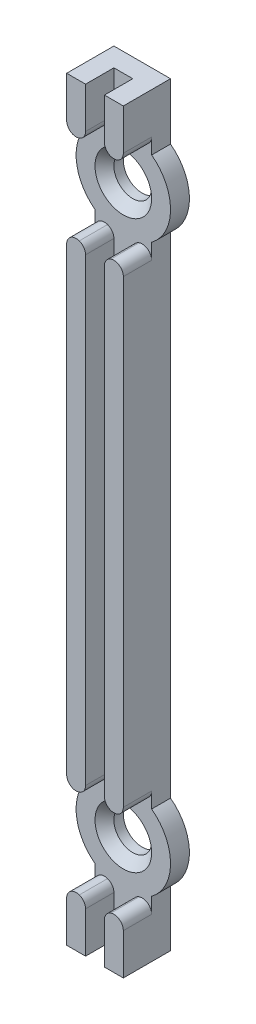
ISO-10303-21;
HEADER;
FILE_DESCRIPTION(('STEP AP214'),'2;1');
FILE_NAME('part.step','',(''),(''),'','','');
FILE_SCHEMA(('AUTOMOTIVE_DESIGN { 1 0 10303 214 1 1 1 1 }'));
ENDSEC;
DATA;
#1=APPLICATION_CONTEXT('core data for automotive mechanical design processes');
#2=APPLICATION_PROTOCOL_DEFINITION('international standard','automotive_design',2000,#1);
#3=PRODUCT_CONTEXT('',#1,'mechanical');
#4=PRODUCT('Part','Part','',(#3));
#5=PRODUCT_RELATED_PRODUCT_CATEGORY('part','',(#4));
#6=PRODUCT_DEFINITION_FORMATION('','',#4);
#7=PRODUCT_DEFINITION_CONTEXT('part definition',#1,'design');
#8=PRODUCT_DEFINITION('design','',#6,#7);
#9=PRODUCT_DEFINITION_SHAPE('','',#8);
#10=(LENGTH_UNIT() NAMED_UNIT(*) SI_UNIT(.MILLI.,.METRE.));
#11=(NAMED_UNIT(*) PLANE_ANGLE_UNIT() SI_UNIT($,.RADIAN.));
#12=(NAMED_UNIT(*) SI_UNIT($,.STERADIAN.) SOLID_ANGLE_UNIT());
#13=UNCERTAINTY_MEASURE_WITH_UNIT(LENGTH_MEASURE(1.E-05),#10,'distance_accuracy_value','');
#14=(GEOMETRIC_REPRESENTATION_CONTEXT(3) GLOBAL_UNCERTAINTY_ASSIGNED_CONTEXT((#13)) GLOBAL_UNIT_ASSIGNED_CONTEXT((#10,
#11,#12)) REPRESENTATION_CONTEXT('',''));
#15=CARTESIAN_POINT('',(0.,0.,0.));
#16=DIRECTION('',(0.,0.,1.));
#17=DIRECTION('',(1.,0.,0.));
#18=AXIS2_PLACEMENT_3D('',#15,#16,#17);
#19=CARTESIAN_POINT('',(0.,-39.7374179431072,5.));
#20=DIRECTION('',(0.,1.,0.));
#21=DIRECTION('',(0.,0.,1.));
#22=AXIS2_PLACEMENT_3D('',#19,#20,#21);
#23=PLANE('',#22);
#24=DIRECTION('',(0.,0.,1.));
#25=VECTOR('',#24,1.);
#26=CARTESIAN_POINT('',(-5.10537351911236,-39.7374179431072,2.));
#27=LINE('',#26,#25);
#28=CARTESIAN_POINT('',(-5.10537351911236,-39.7374179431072,2.));
#29=VERTEX_POINT('',#28);
#30=CARTESIAN_POINT('',(-5.10537351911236,-39.7374179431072,5.));
#31=VERTEX_POINT('',#30);
#32=EDGE_CURVE('E365',#29,#31,#27,.T.);
#33=ORIENTED_EDGE('',*,*,#32,.F.);
#34=DIRECTION('',(1.,0.,0.));
#35=VECTOR('',#34,1.);
#36=CARTESIAN_POINT('',(0.,-39.7374179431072,2.));
#37=LINE('',#36,#35);
#38=CARTESIAN_POINT('',(-7.10537351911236,-39.7374179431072,2.));
#39=VERTEX_POINT('',#38);
#40=EDGE_CURVE('E348',#39,#29,#37,.T.);
#41=ORIENTED_EDGE('',*,*,#40,.F.);
#42=DIRECTION('',(0.,0.,1.));
#43=VECTOR('',#42,1.);
#44=CARTESIAN_POINT('',(-7.10537351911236,-39.7374179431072,2.));
#45=LINE('',#44,#43);
#46=CARTESIAN_POINT('',(-7.10537351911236,-39.7374179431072,5.));
#47=VERTEX_POINT('',#46);
#48=EDGE_CURVE('E358',#39,#47,#45,.T.);
#49=ORIENTED_EDGE('',*,*,#48,.T.);
#50=DIRECTION('',(1.,0.,0.));
#51=VECTOR('',#50,1.);
#52=CARTESIAN_POINT('',(0.,-39.7374179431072,5.));
#53=LINE('',#52,#51);
#54=CARTESIAN_POINT('',(-9.10537351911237,-39.7374179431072,5.));
#55=VERTEX_POINT('',#54);
#56=EDGE_CURVE('E424',#55,#47,#53,.T.);
#57=ORIENTED_EDGE('',*,*,#56,.F.);
#58=DIRECTION('',(0.,0.,-1.));
#59=VECTOR('',#58,1.);
#60=CARTESIAN_POINT('',(-9.10537351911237,-39.7374179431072,5.));
#61=LINE('',#60,#59);
#62=CARTESIAN_POINT('',(-9.10537351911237,-39.7374179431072,0.));
#63=VERTEX_POINT('',#62);
#64=EDGE_CURVE('E490',#55,#63,#61,.T.);
#65=ORIENTED_EDGE('',*,*,#64,.T.);
#66=DIRECTION('',(1.,0.,0.));
#67=VECTOR('',#66,1.);
#68=CARTESIAN_POINT('',(0.,-39.7374179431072,0.));
#69=LINE('',#68,#67);
#70=CARTESIAN_POINT('',(-3.10537351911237,-39.7374179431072,0.));
#71=VERTEX_POINT('',#70);
#72=EDGE_CURVE('E452',#63,#71,#69,.T.);
#73=ORIENTED_EDGE('',*,*,#72,.T.);
#74=DIRECTION('',(0.,0.,-1.));
#75=VECTOR('',#74,1.);
#76=CARTESIAN_POINT('',(-3.10537351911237,-39.7374179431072,5.));
#77=LINE('',#76,#75);
#78=CARTESIAN_POINT('',(-3.10537351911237,-39.7374179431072,5.));
#79=VERTEX_POINT('',#78);
#80=EDGE_CURVE('E488',#79,#71,#77,.T.);
#81=ORIENTED_EDGE('',*,*,#80,.F.);
#82=EDGE_CURVE('E423',#31,#79,#53,.T.);
#83=ORIENTED_EDGE('',*,*,#82,.F.);
#84=EDGE_LOOP('',(#33,#41,#49,#57,#65,#73,#81,#83));
#85=FACE_BOUND('',#84,.T.);
#86=ADVANCED_FACE('F85',(#85),#23,.F.);
#87=CARTESIAN_POINT('',(-6.10537351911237,30.2625820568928,5.));
#88=DIRECTION('',(0.,0.,-1.));
#89=DIRECTION('',(-1.,0.,0.));
#90=AXIS2_PLACEMENT_3D('',#87,#88,#89);
#91=CYLINDRICAL_SURFACE('',#90,5.);
#92=CARTESIAN_POINT('',(-6.10537351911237,30.2625820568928,2.));
#93=DIRECTION('',(0.,0.,1.));
#94=DIRECTION('',(1.,0.,0.));
#95=AXIS2_PLACEMENT_3D('',#92,#93,#94);
#96=CIRCLE('',#95,5.);
#97=CARTESIAN_POINT('',(-3.10537351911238,26.2625820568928,2.));
#98=VERTEX_POINT('',#97);
#99=CARTESIAN_POINT('',(-3.10537351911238,34.2625820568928,2.));
#100=VERTEX_POINT('',#99);
#101=EDGE_CURVE('E380',#98,#100,#96,.T.);
#102=ORIENTED_EDGE('',*,*,#101,.F.);
#103=DIRECTION('',(0.,0.,-1.));
#104=VECTOR('',#103,1.);
#105=CARTESIAN_POINT('',(-3.10537351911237,26.2625820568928,5.));
#106=LINE('',#105,#104);
#107=CARTESIAN_POINT('',(-3.10537351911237,26.2625820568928,0.));
#108=VERTEX_POINT('',#107);
#109=EDGE_CURVE('E482',#98,#108,#106,.T.);
#110=ORIENTED_EDGE('',*,*,#109,.T.);
#111=CARTESIAN_POINT('',(-6.10537351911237,30.2625820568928,0.));
#112=DIRECTION('',(0.,0.,1.));
#113=DIRECTION('',(1.,0.,0.));
#114=AXIS2_PLACEMENT_3D('',#111,#112,#113);
#115=CIRCLE('',#114,5.);
#116=CARTESIAN_POINT('',(-3.10537351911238,34.2625820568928,0.));
#117=VERTEX_POINT('',#116);
#118=EDGE_CURVE('E464',#108,#117,#115,.T.);
#119=ORIENTED_EDGE('',*,*,#118,.T.);
#120=DIRECTION('',(0.,0.,-1.));
#121=VECTOR('',#120,1.);
#122=CARTESIAN_POINT('',(-3.10537351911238,34.2625820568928,5.));
#123=LINE('',#122,#121);
#124=EDGE_CURVE('E480',#100,#117,#123,.T.);
#125=ORIENTED_EDGE('',*,*,#124,.F.);
#126=EDGE_LOOP('',(#102,#110,#119,#125));
#127=FACE_BOUND('',#126,.T.);
#128=ADVANCED_FACE('F703',(#127),#91,.T.);
#129=CARTESIAN_POINT('',(0.,0.,5.));
#130=DIRECTION('',(0.,0.,1.));
#131=DIRECTION('',(1.,0.,0.));
#132=AXIS2_PLACEMENT_3D('',#129,#130,#131);
#133=PLANE('',#132);
#134=CARTESIAN_POINT('',(-4.10537351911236,35.9194363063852,5.));
#135=DIRECTION('',(0.,0.,1.));
#136=DIRECTION('',(1.,0.,0.));
#137=AXIS2_PLACEMENT_3D('',#134,#135,#136);
#138=CIRCLE('',#137,1.);
#139=CARTESIAN_POINT('',(-5.10537351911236,35.9194363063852,5.));
#140=VERTEX_POINT('',#139);
#141=CARTESIAN_POINT('',(-4.4387068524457,34.9766272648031,5.));
#142=VERTEX_POINT('',#141);
#143=EDGE_CURVE('E518',#140,#142,#138,.T.);
#144=ORIENTED_EDGE('',*,*,#143,.T.);
#145=CARTESIAN_POINT('',(-4.10537351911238,35.9194363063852,5.));
#146=DIRECTION('',(0.,0.,1.));
#147=DIRECTION('',(1.,0.,0.));
#148=AXIS2_PLACEMENT_3D('',#145,#146,#147);
#149=CIRCLE('',#148,1.);
#150=CARTESIAN_POINT('',(-3.10537351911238,35.9194363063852,5.));
#151=VERTEX_POINT('',#150);
#152=EDGE_CURVE('E520',#142,#151,#149,.T.);
#153=ORIENTED_EDGE('',*,*,#152,.T.);
#154=DIRECTION('',(0.,-1.,0.));
#155=VECTOR('',#154,1.);
#156=CARTESIAN_POINT('',(-3.10537351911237,0.,5.));
#157=LINE('',#156,#155);
#158=CARTESIAN_POINT('',(-3.10537351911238,40.2625820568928,5.));
#159=VERTEX_POINT('',#158);
#160=EDGE_CURVE('E431',#159,#151,#157,.T.);
#161=ORIENTED_EDGE('',*,*,#160,.F.);
#162=DIRECTION('',(1.,0.,0.));
#163=VECTOR('',#162,1.);
#164=CARTESIAN_POINT('',(0.,40.2625820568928,5.));
#165=LINE('',#164,#163);
#166=CARTESIAN_POINT('',(-5.10537351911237,40.2625820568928,5.));
#167=VERTEX_POINT('',#166);
#168=EDGE_CURVE('E434',#167,#159,#165,.T.);
#169=ORIENTED_EDGE('',*,*,#168,.F.);
#170=DIRECTION('',(0.,-1.,0.));
#171=VECTOR('',#170,1.);
#172=CARTESIAN_POINT('',(-5.10537351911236,0.,5.));
#173=LINE('',#172,#171);
#174=EDGE_CURVE('E404',#167,#140,#173,.T.);
#175=ORIENTED_EDGE('',*,*,#174,.T.);
#176=EDGE_LOOP('',(#144,#153,#161,#169,#175));
#177=FACE_BOUND('',#176,.T.);
#178=ADVANCED_FACE('F708',(#177),#133,.T.);
#179=CARTESIAN_POINT('',(-8.10537351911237,35.9194363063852,5.));
#180=DIRECTION('',(0.,0.,1.));
#181=DIRECTION('',(1.,0.,0.));
#182=AXIS2_PLACEMENT_3D('',#179,#180,#181);
#183=CIRCLE('',#182,1.);
#184=CARTESIAN_POINT('',(-9.10537351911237,35.9194363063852,5.));
#185=VERTEX_POINT('',#184);
#186=CARTESIAN_POINT('',(-7.77204018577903,34.9766272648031,5.));
#187=VERTEX_POINT('',#186);
#188=EDGE_CURVE('E524',#185,#187,#183,.T.);
#189=ORIENTED_EDGE('',*,*,#188,.T.);
#190=CARTESIAN_POINT('',(-8.10537351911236,35.9194363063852,5.));
#191=DIRECTION('',(0.,0.,1.));
#192=DIRECTION('',(1.,0.,0.));
#193=AXIS2_PLACEMENT_3D('',#190,#191,#192);
#194=CIRCLE('',#193,1.);
#195=CARTESIAN_POINT('',(-7.10537351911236,35.9194363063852,5.));
#196=VERTEX_POINT('',#195);
#197=EDGE_CURVE('E526',#187,#196,#194,.T.);
#198=ORIENTED_EDGE('',*,*,#197,.T.);
#199=DIRECTION('',(0.,-1.,0.));
#200=VECTOR('',#199,1.);
#201=CARTESIAN_POINT('',(-7.10537351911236,0.,5.));
#202=LINE('',#201,#200);
#203=CARTESIAN_POINT('',(-7.10537351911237,40.2625820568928,5.));
#204=VERTEX_POINT('',#203);
#205=EDGE_CURVE('E407',#204,#196,#202,.T.);
#206=ORIENTED_EDGE('',*,*,#205,.F.);
#207=CARTESIAN_POINT('',(-9.10537351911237,40.2625820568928,5.));
#208=VERTEX_POINT('',#207);
#209=EDGE_CURVE('E435',#208,#204,#165,.T.);
#210=ORIENTED_EDGE('',*,*,#209,.F.);
#211=DIRECTION('',(0.,-1.,0.));
#212=VECTOR('',#211,1.);
#213=CARTESIAN_POINT('',(-9.10537351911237,0.,5.));
#214=LINE('',#213,#212);
#215=EDGE_CURVE('E438',#208,#185,#214,.T.);
#216=ORIENTED_EDGE('',*,*,#215,.T.);
#217=EDGE_LOOP('',(#189,#198,#206,#210,#216));
#218=FACE_BOUND('',#217,.T.);
#219=ADVANCED_FACE('F847',(#218),#133,.T.);
#220=DIRECTION('',(0.,-1.,0.));
#221=VECTOR('',#220,1.);
#222=CARTESIAN_POINT('',(-3.10537351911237,0.,5.));
#223=LINE('',#222,#221);
#224=CARTESIAN_POINT('',(-3.10537351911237,24.6057278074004,5.));
#225=VERTEX_POINT('',#224);
#226=CARTESIAN_POINT('',(-3.10537351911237,-24.0805636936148,5.));
#227=VERTEX_POINT('',#226);
#228=EDGE_CURVE('E428',#225,#227,#223,.T.);
#229=ORIENTED_EDGE('',*,*,#228,.F.);
#230=CARTESIAN_POINT('',(-4.10537351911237,24.6057278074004,5.));
#231=DIRECTION('',(0.,0.,1.));
#232=DIRECTION('',(1.,0.,0.));
#233=AXIS2_PLACEMENT_3D('',#230,#231,#232);
#234=CIRCLE('',#233,1.);
#235=CARTESIAN_POINT('',(-4.4387068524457,25.5485368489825,5.));
#236=VERTEX_POINT('',#235);
#237=EDGE_CURVE('E553',#225,#236,#234,.T.);
#238=ORIENTED_EDGE('',*,*,#237,.T.);
#239=CARTESIAN_POINT('',(-4.10537351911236,24.6057278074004,5.));
#240=DIRECTION('',(0.,0.,1.));
#241=DIRECTION('',(1.,0.,0.));
#242=AXIS2_PLACEMENT_3D('',#239,#240,#241);
#243=CIRCLE('',#242,1.);
#244=CARTESIAN_POINT('',(-5.10537351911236,24.6057278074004,5.));
#245=VERTEX_POINT('',#244);
#246=EDGE_CURVE('E551',#236,#245,#243,.T.);
#247=ORIENTED_EDGE('',*,*,#246,.T.);
#248=DIRECTION('',(0.,-1.,0.));
#249=VECTOR('',#248,1.);
#250=CARTESIAN_POINT('',(-5.10537351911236,0.,5.));
#251=LINE('',#250,#249);
#252=CARTESIAN_POINT('',(-5.10537351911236,-24.0805636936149,5.));
#253=VERTEX_POINT('',#252);
#254=EDGE_CURVE('E401',#245,#253,#251,.T.);
#255=ORIENTED_EDGE('',*,*,#254,.T.);
#256=CARTESIAN_POINT('',(-4.10537351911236,-24.0805636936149,5.));
#257=DIRECTION('',(0.,0.,1.));
#258=DIRECTION('',(1.,0.,0.));
#259=AXIS2_PLACEMENT_3D('',#256,#257,#258);
#260=CIRCLE('',#259,1.);
#261=CARTESIAN_POINT('',(-4.4387068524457,-25.0233727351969,5.));
#262=VERTEX_POINT('',#261);
#263=EDGE_CURVE('E549',#253,#262,#260,.T.);
#264=ORIENTED_EDGE('',*,*,#263,.T.);
#265=CARTESIAN_POINT('',(-4.10537351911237,-24.0805636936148,5.));
#266=DIRECTION('',(0.,0.,1.));
#267=DIRECTION('',(1.,0.,0.));
#268=AXIS2_PLACEMENT_3D('',#265,#266,#267);
#269=CIRCLE('',#268,1.);
#270=EDGE_CURVE('E547',#262,#227,#269,.T.);
#271=ORIENTED_EDGE('',*,*,#270,.T.);
#272=EDGE_LOOP('',(#229,#238,#247,#255,#264,#271));
#273=FACE_BOUND('',#272,.T.);
#274=ADVANCED_FACE('F845',(#273),#133,.T.);
#275=CARTESIAN_POINT('',(-4.10537351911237,-35.3942721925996,5.));
#276=DIRECTION('',(0.,0.,1.));
#277=DIRECTION('',(1.,0.,0.));
#278=AXIS2_PLACEMENT_3D('',#275,#276,#277);
#279=CIRCLE('',#278,1.);
#280=CARTESIAN_POINT('',(-3.10537351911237,-35.3942721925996,5.));
#281=VERTEX_POINT('',#280);
#282=CARTESIAN_POINT('',(-4.4387068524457,-34.4514631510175,5.));
#283=VERTEX_POINT('',#282);
#284=EDGE_CURVE('E581',#281,#283,#279,.T.);
#285=ORIENTED_EDGE('',*,*,#284,.T.);
#286=CARTESIAN_POINT('',(-4.10537351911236,-35.3942721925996,5.));
#287=DIRECTION('',(0.,0.,1.));
#288=DIRECTION('',(1.,0.,0.));
#289=AXIS2_PLACEMENT_3D('',#286,#287,#288);
#290=CIRCLE('',#289,1.);
#291=CARTESIAN_POINT('',(-5.10537351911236,-35.3942721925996,5.));
#292=VERTEX_POINT('',#291);
#293=EDGE_CURVE('E583',#283,#292,#290,.T.);
#294=ORIENTED_EDGE('',*,*,#293,.T.);
#295=DIRECTION('',(0.,-1.,0.));
#296=VECTOR('',#295,1.);
#297=CARTESIAN_POINT('',(-5.10537351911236,0.,5.));
#298=LINE('',#297,#296);
#299=EDGE_CURVE('E399',#292,#31,#298,.T.);
#300=ORIENTED_EDGE('',*,*,#299,.T.);
#301=ORIENTED_EDGE('',*,*,#82,.T.);
#302=DIRECTION('',(0.,-1.,0.));
#303=VECTOR('',#302,1.);
#304=CARTESIAN_POINT('',(-3.10537351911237,0.,5.));
#305=LINE('',#304,#303);
#306=EDGE_CURVE('E426',#281,#79,#305,.T.);
#307=ORIENTED_EDGE('',*,*,#306,.F.);
#308=EDGE_LOOP('',(#285,#294,#300,#301,#307));
#309=FACE_BOUND('',#308,.T.);
#310=ADVANCED_FACE('F682',(#309),#133,.T.);
#311=CARTESIAN_POINT('',(-8.10537351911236,24.6057278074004,5.));
#312=DIRECTION('',(0.,0.,1.));
#313=DIRECTION('',(1.,0.,0.));
#314=AXIS2_PLACEMENT_3D('',#311,#312,#313);
#315=CIRCLE('',#314,1.);
#316=CARTESIAN_POINT('',(-7.10537351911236,24.6057278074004,5.));
#317=VERTEX_POINT('',#316);
#318=CARTESIAN_POINT('',(-7.77204018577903,25.5485368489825,5.));
#319=VERTEX_POINT('',#318);
#320=EDGE_CURVE('E572',#317,#319,#315,.T.);
#321=ORIENTED_EDGE('',*,*,#320,.T.);
#322=CARTESIAN_POINT('',(-8.10537351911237,24.6057278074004,5.));
#323=DIRECTION('',(0.,0.,1.));
#324=DIRECTION('',(1.,0.,0.));
#325=AXIS2_PLACEMENT_3D('',#322,#323,#324);
#326=CIRCLE('',#325,1.);
#327=CARTESIAN_POINT('',(-9.10537351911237,24.6057278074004,5.));
#328=VERTEX_POINT('',#327);
#329=EDGE_CURVE('E574',#319,#328,#326,.T.);
#330=ORIENTED_EDGE('',*,*,#329,.T.);
#331=DIRECTION('',(0.,-1.,0.));
#332=VECTOR('',#331,1.);
#333=CARTESIAN_POINT('',(-9.10537351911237,0.,5.));
#334=LINE('',#333,#332);
#335=CARTESIAN_POINT('',(-9.10537351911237,-24.0805636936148,5.));
#336=VERTEX_POINT('',#335);
#337=EDGE_CURVE('E417',#328,#336,#334,.T.);
#338=ORIENTED_EDGE('',*,*,#337,.T.);
#339=CARTESIAN_POINT('',(-8.10537351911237,-24.0805636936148,5.));
#340=DIRECTION('',(0.,0.,1.));
#341=DIRECTION('',(1.,0.,0.));
#342=AXIS2_PLACEMENT_3D('',#339,#340,#341);
#343=CIRCLE('',#342,1.);
#344=CARTESIAN_POINT('',(-7.77204018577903,-25.0233727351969,5.));
#345=VERTEX_POINT('',#344);
#346=EDGE_CURVE('E568',#336,#345,#343,.T.);
#347=ORIENTED_EDGE('',*,*,#346,.T.);
#348=CARTESIAN_POINT('',(-8.10537351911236,-24.0805636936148,5.));
#349=DIRECTION('',(0.,0.,1.));
#350=DIRECTION('',(1.,0.,0.));
#351=AXIS2_PLACEMENT_3D('',#348,#349,#350);
#352=CIRCLE('',#351,1.);
#353=CARTESIAN_POINT('',(-7.10537351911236,-24.0805636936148,5.));
#354=VERTEX_POINT('',#353);
#355=EDGE_CURVE('E570',#345,#354,#352,.T.);
#356=ORIENTED_EDGE('',*,*,#355,.T.);
#357=DIRECTION('',(0.,-1.,0.));
#358=VECTOR('',#357,1.);
#359=CARTESIAN_POINT('',(-7.10537351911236,0.,5.));
#360=LINE('',#359,#358);
#361=EDGE_CURVE('E394',#317,#354,#360,.T.);
#362=ORIENTED_EDGE('',*,*,#361,.F.);
#363=EDGE_LOOP('',(#321,#330,#338,#347,#356,#362));
#364=FACE_BOUND('',#363,.T.);
#365=ADVANCED_FACE('F795',(#364),#133,.T.);
#366=CARTESIAN_POINT('',(-6.10537351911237,-29.7374179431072,5.));
#367=DIRECTION('',(0.,0.,-1.));
#368=DIRECTION('',(-1.,0.,0.));
#369=AXIS2_PLACEMENT_3D('',#366,#367,#368);
#370=CYLINDRICAL_SURFACE('',#369,5.);
#371=CARTESIAN_POINT('',(-6.10537351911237,-29.7374179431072,2.));
#372=DIRECTION('',(0.,0.,1.));
#373=DIRECTION('',(1.,0.,0.));
#374=AXIS2_PLACEMENT_3D('',#371,#372,#373);
#375=CIRCLE('',#374,5.);
#376=CARTESIAN_POINT('',(-3.10537351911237,-33.7374179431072,2.));
#377=VERTEX_POINT('',#376);
#378=CARTESIAN_POINT('',(-3.10537351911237,-25.7374179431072,2.));
#379=VERTEX_POINT('',#378);
#380=EDGE_CURVE('E372',#377,#379,#375,.T.);
#381=ORIENTED_EDGE('',*,*,#380,.F.);
#382=DIRECTION('',(0.,0.,-1.));
#383=VECTOR('',#382,1.);
#384=CARTESIAN_POINT('',(-3.10537351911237,-33.7374179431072,5.));
#385=LINE('',#384,#383);
#386=CARTESIAN_POINT('',(-3.10537351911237,-33.7374179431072,0.));
#387=VERTEX_POINT('',#386);
#388=EDGE_CURVE('E486',#377,#387,#385,.T.);
#389=ORIENTED_EDGE('',*,*,#388,.T.);
#390=CARTESIAN_POINT('',(-6.10537351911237,-29.7374179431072,0.));
#391=DIRECTION('',(0.,0.,1.));
#392=DIRECTION('',(1.,0.,0.));
#393=AXIS2_PLACEMENT_3D('',#390,#391,#392);
#394=CIRCLE('',#393,5.);
#395=CARTESIAN_POINT('',(-3.10537351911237,-25.7374179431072,0.));
#396=VERTEX_POINT('',#395);
#397=EDGE_CURVE('E458',#387,#396,#394,.T.);
#398=ORIENTED_EDGE('',*,*,#397,.T.);
#399=DIRECTION('',(0.,0.,-1.));
#400=VECTOR('',#399,1.);
#401=CARTESIAN_POINT('',(-3.10537351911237,-25.7374179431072,5.));
#402=LINE('',#401,#400);
#403=EDGE_CURVE('E484',#379,#396,#402,.T.);
#404=ORIENTED_EDGE('',*,*,#403,.F.);
#405=EDGE_LOOP('',(#381,#389,#398,#404));
#406=FACE_BOUND('',#405,.T.);
#407=ADVANCED_FACE('F730',(#406),#370,.T.);
#408=CARTESIAN_POINT('',(-6.10537351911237,30.2625820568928,5.));
#409=DIRECTION('',(0.,0.,-1.));
#410=DIRECTION('',(-1.,0.,0.));
#411=AXIS2_PLACEMENT_3D('',#408,#409,#410);
#412=CYLINDRICAL_SURFACE('',#411,5.);
#413=CARTESIAN_POINT('',(-6.10537351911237,30.2625820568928,2.));
#414=DIRECTION('',(0.,0.,1.));
#415=DIRECTION('',(1.,0.,0.));
#416=AXIS2_PLACEMENT_3D('',#413,#414,#415);
#417=CIRCLE('',#416,5.);
#418=CARTESIAN_POINT('',(-9.10537351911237,34.2625820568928,2.));
#419=VERTEX_POINT('',#418);
#420=CARTESIAN_POINT('',(-9.10537351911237,26.2625820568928,2.));
#421=VERTEX_POINT('',#420);
#422=EDGE_CURVE('E366',#419,#421,#417,.T.);
#423=ORIENTED_EDGE('',*,*,#422,.F.);
#424=DIRECTION('',(0.,0.,-1.));
#425=VECTOR('',#424,1.);
#426=CARTESIAN_POINT('',(-9.10537351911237,34.2625820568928,5.));
#427=LINE('',#426,#425);
#428=CARTESIAN_POINT('',(-9.10537351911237,34.2625820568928,0.));
#429=VERTEX_POINT('',#428);
#430=EDGE_CURVE('E441',#419,#429,#427,.T.);
#431=ORIENTED_EDGE('',*,*,#430,.T.);
#432=CARTESIAN_POINT('',(-6.10537351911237,30.2625820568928,0.));
#433=DIRECTION('',(0.,0.,1.));
#434=DIRECTION('',(1.,0.,0.));
#435=AXIS2_PLACEMENT_3D('',#432,#433,#434);
#436=CIRCLE('',#435,5.);
#437=CARTESIAN_POINT('',(-9.10537351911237,26.2625820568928,0.));
#438=VERTEX_POINT('',#437);
#439=EDGE_CURVE('E412',#429,#438,#436,.T.);
#440=ORIENTED_EDGE('',*,*,#439,.T.);
#441=DIRECTION('',(0.,0.,-1.));
#442=VECTOR('',#441,1.);
#443=CARTESIAN_POINT('',(-9.10537351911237,26.2625820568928,5.));
#444=LINE('',#443,#442);
#445=EDGE_CURVE('E497',#421,#438,#444,.T.);
#446=ORIENTED_EDGE('',*,*,#445,.F.);
#447=EDGE_LOOP('',(#423,#431,#440,#446));
#448=FACE_BOUND('',#447,.T.);
#449=ADVANCED_FACE('F722',(#448),#412,.T.);
#450=CARTESIAN_POINT('',(-6.10537351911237,-29.7374179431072,5.));
#451=DIRECTION('',(0.,0.,-1.));
#452=DIRECTION('',(-1.,0.,0.));
#453=AXIS2_PLACEMENT_3D('',#450,#451,#452);
#454=CYLINDRICAL_SURFACE('',#453,5.);
#455=CARTESIAN_POINT('',(-6.10537351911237,-29.7374179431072,2.));
#456=DIRECTION('',(0.,0.,1.));
#457=DIRECTION('',(1.,0.,0.));
#458=AXIS2_PLACEMENT_3D('',#455,#456,#457);
#459=CIRCLE('',#458,5.);
#460=CARTESIAN_POINT('',(-9.10537351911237,-25.7374179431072,2.));
#461=VERTEX_POINT('',#460);
#462=CARTESIAN_POINT('',(-9.10537351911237,-33.7374179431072,2.));
#463=VERTEX_POINT('',#462);
#464=EDGE_CURVE('E499',#461,#463,#459,.T.);
#465=ORIENTED_EDGE('',*,*,#464,.F.);
#466=DIRECTION('',(0.,0.,-1.));
#467=VECTOR('',#466,1.);
#468=CARTESIAN_POINT('',(-9.10537351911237,-25.7374179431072,5.));
#469=LINE('',#468,#467);
#470=CARTESIAN_POINT('',(-9.10537351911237,-25.7374179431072,0.));
#471=VERTEX_POINT('',#470);
#472=EDGE_CURVE('E495',#461,#471,#469,.T.);
#473=ORIENTED_EDGE('',*,*,#472,.T.);
#474=CARTESIAN_POINT('',(-6.10537351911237,-29.7374179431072,0.));
#475=DIRECTION('',(0.,0.,1.));
#476=DIRECTION('',(1.,0.,0.));
#477=AXIS2_PLACEMENT_3D('',#474,#475,#476);
#478=CIRCLE('',#477,5.);
#479=CARTESIAN_POINT('',(-9.10537351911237,-33.7374179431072,0.));
#480=VERTEX_POINT('',#479);
#481=EDGE_CURVE('E447',#471,#480,#478,.T.);
#482=ORIENTED_EDGE('',*,*,#481,.T.);
#483=DIRECTION('',(0.,0.,-1.));
#484=VECTOR('',#483,1.);
#485=CARTESIAN_POINT('',(-9.10537351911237,-33.7374179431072,5.));
#486=LINE('',#485,#484);
#487=EDGE_CURVE('E493',#463,#480,#486,.T.);
#488=ORIENTED_EDGE('',*,*,#487,.F.);
#489=EDGE_LOOP('',(#465,#473,#482,#488));
#490=FACE_BOUND('',#489,.T.);
#491=ADVANCED_FACE('F718',(#490),#454,.T.);
#492=CARTESIAN_POINT('',(-3.10537351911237,0.,5.));
#493=DIRECTION('',(1.,0.,0.));
#494=DIRECTION('',(0.,1.,0.));
#495=AXIS2_PLACEMENT_3D('',#492,#493,#494);
#496=PLANE('',#495);
#497=ORIENTED_EDGE('',*,*,#160,.T.);
#498=DIRECTION('',(0.,0.,-1.));
#499=VECTOR('',#498,1.);
#500=CARTESIAN_POINT('',(-3.10537351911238,35.9194363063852,2.));
#501=LINE('',#500,#499);
#502=CARTESIAN_POINT('',(-3.10537351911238,35.9194363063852,2.));
#503=VERTEX_POINT('',#502);
#504=EDGE_CURVE('E515',#151,#503,#501,.T.);
#505=ORIENTED_EDGE('',*,*,#504,.T.);
#506=DIRECTION('',(0.,-1.,0.));
#507=VECTOR('',#506,1.);
#508=CARTESIAN_POINT('',(-3.10537351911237,0.,2.));
#509=LINE('',#508,#507);
#510=EDGE_CURVE('E513',#503,#100,#509,.T.);
#511=ORIENTED_EDGE('',*,*,#510,.T.);
#512=ORIENTED_EDGE('',*,*,#124,.T.);
#513=DIRECTION('',(0.,-1.,0.));
#514=VECTOR('',#513,1.);
#515=CARTESIAN_POINT('',(-3.10537351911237,0.,0.));
#516=LINE('',#515,#514);
#517=CARTESIAN_POINT('',(-3.10537351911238,40.2625820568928,0.));
#518=VERTEX_POINT('',#517);
#519=EDGE_CURVE('E467',#518,#117,#516,.T.);
#520=ORIENTED_EDGE('',*,*,#519,.F.);
#521=DIRECTION('',(0.,0.,-1.));
#522=VECTOR('',#521,1.);
#523=CARTESIAN_POINT('',(-3.10537351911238,40.2625820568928,5.));
#524=LINE('',#523,#522);
#525=EDGE_CURVE('E478',#159,#518,#524,.T.);
#526=ORIENTED_EDGE('',*,*,#525,.F.);
#527=EDGE_LOOP('',(#497,#505,#511,#512,#520,#526));
#528=FACE_BOUND('',#527,.T.);
#529=ADVANCED_FACE('F721',(#528),#496,.T.);
#530=CARTESIAN_POINT('',(-3.10537351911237,0.,5.));
#531=DIRECTION('',(1.,0.,0.));
#532=DIRECTION('',(0.,1.,0.));
#533=AXIS2_PLACEMENT_3D('',#530,#531,#532);
#534=PLANE('',#533);
#535=ORIENTED_EDGE('',*,*,#109,.F.);
#536=DIRECTION('',(0.,-1.,0.));
#537=VECTOR('',#536,1.);
#538=CARTESIAN_POINT('',(-3.10537351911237,0.,2.));
#539=LINE('',#538,#537);
#540=CARTESIAN_POINT('',(-3.10537351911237,24.6057278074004,2.));
#541=VERTEX_POINT('',#540);
#542=EDGE_CURVE('E544',#98,#541,#539,.T.);
#543=ORIENTED_EDGE('',*,*,#542,.T.);
#544=DIRECTION('',(0.,0.,-1.));
#545=VECTOR('',#544,1.);
#546=CARTESIAN_POINT('',(-3.10537351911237,24.6057278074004,5.));
#547=LINE('',#546,#545);
#548=EDGE_CURVE('E541',#541,#225,#547,.F.);
#549=ORIENTED_EDGE('',*,*,#548,.T.);
#550=ORIENTED_EDGE('',*,*,#228,.T.);
#551=DIRECTION('',(0.,0.,-1.));
#552=VECTOR('',#551,1.);
#553=CARTESIAN_POINT('',(-3.10537351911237,-24.0805636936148,2.));
#554=LINE('',#553,#552);
#555=CARTESIAN_POINT('',(-3.10537351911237,-24.0805636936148,2.));
#556=VERTEX_POINT('',#555);
#557=EDGE_CURVE('E538',#227,#556,#554,.T.);
#558=ORIENTED_EDGE('',*,*,#557,.T.);
#559=DIRECTION('',(0.,-1.,0.));
#560=VECTOR('',#559,1.);
#561=CARTESIAN_POINT('',(-3.10537351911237,0.,2.));
#562=LINE('',#561,#560);
#563=EDGE_CURVE('E536',#556,#379,#562,.T.);
#564=ORIENTED_EDGE('',*,*,#563,.T.);
#565=ORIENTED_EDGE('',*,*,#403,.T.);
#566=DIRECTION('',(0.,-1.,0.));
#567=VECTOR('',#566,1.);
#568=CARTESIAN_POINT('',(-3.10537351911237,0.,0.));
#569=LINE('',#568,#567);
#570=EDGE_CURVE('E461',#108,#396,#569,.T.);
#571=ORIENTED_EDGE('',*,*,#570,.F.);
#572=EDGE_LOOP('',(#535,#543,#549,#550,#558,#564,#565,#571));
#573=FACE_BOUND('',#572,.T.);
#574=ADVANCED_FACE('F823',(#573),#534,.T.);
#575=CARTESIAN_POINT('',(-3.10537351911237,0.,5.));
#576=DIRECTION('',(1.,0.,0.));
#577=DIRECTION('',(0.,1.,0.));
#578=AXIS2_PLACEMENT_3D('',#575,#576,#577);
#579=PLANE('',#578);
#580=ORIENTED_EDGE('',*,*,#388,.F.);
#581=DIRECTION('',(0.,-1.,0.));
#582=VECTOR('',#581,1.);
#583=CARTESIAN_POINT('',(-3.10537351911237,0.,2.));
#584=LINE('',#583,#582);
#585=CARTESIAN_POINT('',(-3.10537351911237,-35.3942721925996,2.));
#586=VERTEX_POINT('',#585);
#587=EDGE_CURVE('E109',#377,#586,#584,.T.);
#588=ORIENTED_EDGE('',*,*,#587,.T.);
#589=DIRECTION('',(0.,0.,-1.));
#590=VECTOR('',#589,1.);
#591=CARTESIAN_POINT('',(-3.10537351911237,-35.3942721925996,5.));
#592=LINE('',#591,#590);
#593=EDGE_CURVE('E599',#586,#281,#592,.F.);
#594=ORIENTED_EDGE('',*,*,#593,.T.);
#595=ORIENTED_EDGE('',*,*,#306,.T.);
#596=ORIENTED_EDGE('',*,*,#80,.T.);
#597=DIRECTION('',(0.,-1.,0.));
#598=VECTOR('',#597,1.);
#599=CARTESIAN_POINT('',(-3.10537351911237,0.,0.));
#600=LINE('',#599,#598);
#601=EDGE_CURVE('E455',#387,#71,#600,.T.);
#602=ORIENTED_EDGE('',*,*,#601,.F.);
#603=EDGE_LOOP('',(#580,#588,#594,#595,#596,#602));
#604=FACE_BOUND('',#603,.T.);
#605=ADVANCED_FACE('F677',(#604),#579,.T.);
#606=CARTESIAN_POINT('',(-9.10537351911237,0.,5.));
#607=DIRECTION('',(1.,0.,0.));
#608=DIRECTION('',(0.,0.,-1.));
#609=AXIS2_PLACEMENT_3D('',#606,#607,#608);
#610=PLANE('',#609);
#611=ORIENTED_EDGE('',*,*,#430,.F.);
#612=DIRECTION('',(0.,1.,0.));
#613=VECTOR('',#612,1.);
#614=CARTESIAN_POINT('',(-9.10537351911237,0.,2.));
#615=LINE('',#614,#613);
#616=CARTESIAN_POINT('',(-9.10537351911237,35.9194363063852,2.));
#617=VERTEX_POINT('',#616);
#618=EDGE_CURVE('E533',#419,#617,#615,.T.);
#619=ORIENTED_EDGE('',*,*,#618,.T.);
#620=DIRECTION('',(0.,0.,1.));
#621=VECTOR('',#620,1.);
#622=CARTESIAN_POINT('',(-9.10537351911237,35.9194363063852,5.));
#623=LINE('',#622,#621);
#624=EDGE_CURVE('E531',#617,#185,#623,.T.);
#625=ORIENTED_EDGE('',*,*,#624,.T.);
#626=ORIENTED_EDGE('',*,*,#215,.F.);
#627=DIRECTION('',(0.,0.,-1.));
#628=VECTOR('',#627,1.);
#629=CARTESIAN_POINT('',(-9.10537351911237,40.2625820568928,5.));
#630=LINE('',#629,#628);
#631=CARTESIAN_POINT('',(-9.10537351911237,40.2625820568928,0.));
#632=VERTEX_POINT('',#631);
#633=EDGE_CURVE('E476',#208,#632,#630,.T.);
#634=ORIENTED_EDGE('',*,*,#633,.T.);
#635=DIRECTION('',(0.,-1.,0.));
#636=VECTOR('',#635,1.);
#637=CARTESIAN_POINT('',(-9.10537351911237,0.,0.));
#638=LINE('',#637,#636);
#639=EDGE_CURVE('E421',#632,#429,#638,.T.);
#640=ORIENTED_EDGE('',*,*,#639,.T.);
#641=EDGE_LOOP('',(#611,#619,#625,#626,#634,#640));
#642=FACE_BOUND('',#641,.T.);
#643=ADVANCED_FACE('F726',(#642),#610,.F.);
#644=CARTESIAN_POINT('',(-9.10537351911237,0.,5.));
#645=DIRECTION('',(1.,0.,0.));
#646=DIRECTION('',(0.,0.,-1.));
#647=AXIS2_PLACEMENT_3D('',#644,#645,#646);
#648=PLANE('',#647);
#649=ORIENTED_EDGE('',*,*,#337,.F.);
#650=DIRECTION('',(0.,0.,1.));
#651=VECTOR('',#650,1.);
#652=CARTESIAN_POINT('',(-9.10537351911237,24.6057278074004,5.));
#653=LINE('',#652,#651);
#654=CARTESIAN_POINT('',(-9.10537351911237,24.6057278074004,2.));
#655=VERTEX_POINT('',#654);
#656=EDGE_CURVE('E565',#328,#655,#653,.F.);
#657=ORIENTED_EDGE('',*,*,#656,.T.);
#658=DIRECTION('',(0.,1.,0.));
#659=VECTOR('',#658,1.);
#660=CARTESIAN_POINT('',(-9.10537351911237,0.,2.));
#661=LINE('',#660,#659);
#662=EDGE_CURVE('E563',#655,#421,#661,.T.);
#663=ORIENTED_EDGE('',*,*,#662,.T.);
#664=ORIENTED_EDGE('',*,*,#445,.T.);
#665=DIRECTION('',(0.,-1.,0.));
#666=VECTOR('',#665,1.);
#667=CARTESIAN_POINT('',(-9.10537351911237,0.,0.));
#668=LINE('',#667,#666);
#669=EDGE_CURVE('E444',#438,#471,#668,.T.);
#670=ORIENTED_EDGE('',*,*,#669,.T.);
#671=ORIENTED_EDGE('',*,*,#472,.F.);
#672=DIRECTION('',(0.,1.,0.));
#673=VECTOR('',#672,1.);
#674=CARTESIAN_POINT('',(-9.10537351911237,0.,2.));
#675=LINE('',#674,#673);
#676=CARTESIAN_POINT('',(-9.10537351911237,-24.0805636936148,2.));
#677=VERTEX_POINT('',#676);
#678=EDGE_CURVE('E102',#461,#677,#675,.T.);
#679=ORIENTED_EDGE('',*,*,#678,.T.);
#680=DIRECTION('',(0.,0.,1.));
#681=VECTOR('',#680,1.);
#682=CARTESIAN_POINT('',(-9.10537351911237,-24.0805636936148,5.));
#683=LINE('',#682,#681);
#684=EDGE_CURVE('E560',#677,#336,#683,.T.);
#685=ORIENTED_EDGE('',*,*,#684,.T.);
#686=EDGE_LOOP('',(#649,#657,#663,#664,#670,#671,#679,#685));
#687=FACE_BOUND('',#686,.T.);
#688=ADVANCED_FACE('F717',(#687),#648,.F.);
#689=CARTESIAN_POINT('',(-9.10537351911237,0.,5.));
#690=DIRECTION('',(1.,0.,0.));
#691=DIRECTION('',(0.,0.,-1.));
#692=AXIS2_PLACEMENT_3D('',#689,#690,#691);
#693=PLANE('',#692);
#694=DIRECTION('',(0.,-1.,0.));
#695=VECTOR('',#694,1.);
#696=CARTESIAN_POINT('',(-9.10537351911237,0.,5.));
#697=LINE('',#696,#695);
#698=CARTESIAN_POINT('',(-9.10537351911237,-35.3942721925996,5.));
#699=VERTEX_POINT('',#698);
#700=EDGE_CURVE('E420',#699,#55,#697,.T.);
#701=ORIENTED_EDGE('',*,*,#700,.F.);
#702=DIRECTION('',(0.,0.,1.));
#703=VECTOR('',#702,1.);
#704=CARTESIAN_POINT('',(-9.10537351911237,-35.3942721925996,5.));
#705=LINE('',#704,#703);
#706=CARTESIAN_POINT('',(-9.10537351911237,-35.3942721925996,2.));
#707=VERTEX_POINT('',#706);
#708=EDGE_CURVE('E596',#699,#707,#705,.F.);
#709=ORIENTED_EDGE('',*,*,#708,.T.);
#710=DIRECTION('',(0.,1.,0.));
#711=VECTOR('',#710,1.);
#712=CARTESIAN_POINT('',(-9.10537351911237,0.,2.));
#713=LINE('',#712,#711);
#714=EDGE_CURVE('E594',#707,#463,#713,.T.);
#715=ORIENTED_EDGE('',*,*,#714,.T.);
#716=ORIENTED_EDGE('',*,*,#487,.T.);
#717=DIRECTION('',(0.,-1.,0.));
#718=VECTOR('',#717,1.);
#719=CARTESIAN_POINT('',(-9.10537351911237,0.,0.));
#720=LINE('',#719,#718);
#721=EDGE_CURVE('E450',#480,#63,#720,.T.);
#722=ORIENTED_EDGE('',*,*,#721,.T.);
#723=ORIENTED_EDGE('',*,*,#64,.F.);
#724=EDGE_LOOP('',(#701,#709,#715,#716,#722,#723));
#725=FACE_BOUND('',#724,.T.);
#726=ADVANCED_FACE('F666',(#725),#693,.F.);
#727=CARTESIAN_POINT('',(0.,40.2625820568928,5.));
#728=DIRECTION('',(0.,1.,0.));
#729=DIRECTION('',(-1.,0.,0.));
#730=AXIS2_PLACEMENT_3D('',#727,#728,#729);
#731=PLANE('',#730);
#732=DIRECTION('',(0.,0.,1.));
#733=VECTOR('',#732,1.);
#734=CARTESIAN_POINT('',(-7.10537351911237,40.2625820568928,2.));
#735=LINE('',#734,#733);
#736=CARTESIAN_POINT('',(-7.10537351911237,40.2625820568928,2.));
#737=VERTEX_POINT('',#736);
#738=EDGE_CURVE('E410',#737,#204,#735,.T.);
#739=ORIENTED_EDGE('',*,*,#738,.F.);
#740=DIRECTION('',(-1.,0.,0.));
#741=VECTOR('',#740,1.);
#742=CARTESIAN_POINT('',(0.,40.2625820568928,2.));
#743=LINE('',#742,#741);
#744=CARTESIAN_POINT('',(-5.10537351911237,40.2625820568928,2.));
#745=VERTEX_POINT('',#744);
#746=EDGE_CURVE('E386',#745,#737,#743,.T.);
#747=ORIENTED_EDGE('',*,*,#746,.F.);
#748=DIRECTION('',(0.,0.,1.));
#749=VECTOR('',#748,1.);
#750=CARTESIAN_POINT('',(-5.10537351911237,40.2625820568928,2.));
#751=LINE('',#750,#749);
#752=EDGE_CURVE('E413',#745,#167,#751,.T.);
#753=ORIENTED_EDGE('',*,*,#752,.T.);
#754=ORIENTED_EDGE('',*,*,#168,.T.);
#755=ORIENTED_EDGE('',*,*,#525,.T.);
#756=DIRECTION('',(1.,0.,0.));
#757=VECTOR('',#756,1.);
#758=CARTESIAN_POINT('',(0.,40.2625820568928,0.));
#759=LINE('',#758,#757);
#760=EDGE_CURVE('E470',#632,#518,#759,.T.);
#761=ORIENTED_EDGE('',*,*,#760,.F.);
#762=ORIENTED_EDGE('',*,*,#633,.F.);
#763=ORIENTED_EDGE('',*,*,#209,.T.);
#764=EDGE_LOOP('',(#739,#747,#753,#754,#755,#761,#762,#763));
#765=FACE_BOUND('',#764,.T.);
#766=ADVANCED_FACE('F716',(#765),#731,.T.);
#767=CARTESIAN_POINT('',(0.,0.,0.));
#768=DIRECTION('',(0.,0.,1.));
#769=DIRECTION('',(1.,0.,0.));
#770=AXIS2_PLACEMENT_3D('',#767,#768,#769);
#771=PLANE('',#770);
#772=CARTESIAN_POINT('',(-6.10537351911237,-29.7374179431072,0.));
#773=DIRECTION('',(0.,0.,1.));
#774=DIRECTION('',(1.,0.,0.));
#775=AXIS2_PLACEMENT_3D('',#772,#773,#774);
#776=CIRCLE('',#775,2.);
#777=CARTESIAN_POINT('',(-4.10537351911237,-29.7374179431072,0.));
#778=VERTEX_POINT('',#777);
#779=EDGE_CURVE('E633',#778,#778,#776,.T.);
#780=ORIENTED_EDGE('',*,*,#779,.T.);
#781=EDGE_LOOP('',(#780));
#782=FACE_BOUND('',#781,.T.);
#783=CARTESIAN_POINT('',(-6.10537351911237,30.2625820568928,0.));
#784=DIRECTION('',(0.,0.,1.));
#785=DIRECTION('',(1.,0.,0.));
#786=AXIS2_PLACEMENT_3D('',#783,#784,#785);
#787=CIRCLE('',#786,2.);
#788=CARTESIAN_POINT('',(-4.10537351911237,30.2625820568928,0.));
#789=VERTEX_POINT('',#788);
#790=EDGE_CURVE('E397',#789,#789,#787,.T.);
#791=ORIENTED_EDGE('',*,*,#790,.T.);
#792=EDGE_LOOP('',(#791));
#793=FACE_BOUND('',#792,.T.);
#794=ORIENTED_EDGE('',*,*,#118,.F.);
#795=ORIENTED_EDGE('',*,*,#570,.T.);
#796=ORIENTED_EDGE('',*,*,#397,.F.);
#797=ORIENTED_EDGE('',*,*,#601,.T.);
#798=ORIENTED_EDGE('',*,*,#72,.F.);
#799=ORIENTED_EDGE('',*,*,#721,.F.);
#800=ORIENTED_EDGE('',*,*,#481,.F.);
#801=ORIENTED_EDGE('',*,*,#669,.F.);
#802=ORIENTED_EDGE('',*,*,#439,.F.);
#803=ORIENTED_EDGE('',*,*,#639,.F.);
#804=ORIENTED_EDGE('',*,*,#760,.T.);
#805=ORIENTED_EDGE('',*,*,#519,.T.);
#806=EDGE_LOOP('',(#794,#795,#796,#797,#798,#799,#800,#801,#802,#803,#804,#805));
#807=FACE_BOUND('',#806,.T.);
#808=ADVANCED_FACE('F672',(#782,#793,#807),#771,.F.);
#809=DIRECTION('',(0.,-1.,0.));
#810=VECTOR('',#809,1.);
#811=CARTESIAN_POINT('',(-7.10537351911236,0.,5.));
#812=LINE('',#811,#810);
#813=CARTESIAN_POINT('',(-7.10537351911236,-35.3942721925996,5.));
#814=VERTEX_POINT('',#813);
#815=EDGE_CURVE('E361',#814,#47,#812,.T.);
#816=ORIENTED_EDGE('',*,*,#815,.F.);
#817=CARTESIAN_POINT('',(-8.10537351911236,-35.3942721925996,5.));
#818=DIRECTION('',(0.,0.,1.));
#819=DIRECTION('',(1.,0.,0.));
#820=AXIS2_PLACEMENT_3D('',#817,#818,#819);
#821=CIRCLE('',#820,1.);
#822=CARTESIAN_POINT('',(-7.77204018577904,-34.4514631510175,5.));
#823=VERTEX_POINT('',#822);
#824=EDGE_CURVE('E592',#814,#823,#821,.T.);
#825=ORIENTED_EDGE('',*,*,#824,.T.);
#826=CARTESIAN_POINT('',(-8.10537351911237,-35.3942721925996,5.));
#827=DIRECTION('',(0.,0.,1.));
#828=DIRECTION('',(1.,0.,0.));
#829=AXIS2_PLACEMENT_3D('',#826,#827,#828);
#830=CIRCLE('',#829,1.);
#831=EDGE_CURVE('E590',#823,#699,#830,.T.);
#832=ORIENTED_EDGE('',*,*,#831,.T.);
#833=ORIENTED_EDGE('',*,*,#700,.T.);
#834=ORIENTED_EDGE('',*,*,#56,.T.);
#835=EDGE_LOOP('',(#816,#825,#832,#833,#834));
#836=FACE_BOUND('',#835,.T.);
#837=ADVANCED_FACE('F663',(#836),#133,.T.);
#838=CARTESIAN_POINT('',(-7.10537351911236,0.,2.));
#839=DIRECTION('',(-1.,0.,0.));
#840=DIRECTION('',(0.,-1.,0.));
#841=AXIS2_PLACEMENT_3D('',#838,#839,#840);
#842=PLANE('',#841);
#843=DIRECTION('',(0.,-1.,0.));
#844=VECTOR('',#843,1.);
#845=CARTESIAN_POINT('',(-7.10537351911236,0.,2.));
#846=LINE('',#845,#844);
#847=CARTESIAN_POINT('',(-7.10537351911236,24.6057278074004,2.));
#848=VERTEX_POINT('',#847);
#849=CARTESIAN_POINT('',(-7.10537351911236,-24.0805636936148,2.));
#850=VERTEX_POINT('',#849);
#851=EDGE_CURVE('E355',#848,#850,#846,.T.);
#852=ORIENTED_EDGE('',*,*,#851,.F.);
#853=DIRECTION('',(0.,0.,1.));
#854=VECTOR('',#853,1.);
#855=CARTESIAN_POINT('',(-7.10537351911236,24.6057278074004,2.));
#856=LINE('',#855,#854);
#857=EDGE_CURVE('E579',#848,#317,#856,.T.);
#858=ORIENTED_EDGE('',*,*,#857,.T.);
#859=ORIENTED_EDGE('',*,*,#361,.T.);
#860=DIRECTION('',(0.,0.,1.));
#861=VECTOR('',#860,1.);
#862=CARTESIAN_POINT('',(-7.10537351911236,-24.0805636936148,2.));
#863=LINE('',#862,#861);
#864=EDGE_CURVE('E576',#354,#850,#863,.F.);
#865=ORIENTED_EDGE('',*,*,#864,.T.);
#866=EDGE_LOOP('',(#852,#858,#859,#865));
#867=FACE_BOUND('',#866,.T.);
#868=ADVANCED_FACE('F857',(#867),#842,.F.);
#869=CARTESIAN_POINT('',(-7.10537351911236,0.,2.));
#870=DIRECTION('',(-1.,0.,0.));
#871=DIRECTION('',(0.,-1.,0.));
#872=AXIS2_PLACEMENT_3D('',#869,#870,#871);
#873=PLANE('',#872);
#874=ORIENTED_EDGE('',*,*,#205,.T.);
#875=DIRECTION('',(0.,0.,1.));
#876=VECTOR('',#875,1.);
#877=CARTESIAN_POINT('',(-7.10537351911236,35.9194363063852,2.));
#878=LINE('',#877,#876);
#879=CARTESIAN_POINT('',(-7.10537351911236,35.9194363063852,2.));
#880=VERTEX_POINT('',#879);
#881=EDGE_CURVE('E528',#196,#880,#878,.F.);
#882=ORIENTED_EDGE('',*,*,#881,.T.);
#883=DIRECTION('',(0.,-1.,0.));
#884=VECTOR('',#883,1.);
#885=CARTESIAN_POINT('',(-7.10537351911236,0.,2.));
#886=LINE('',#885,#884);
#887=EDGE_CURVE('E389',#737,#880,#886,.T.);
#888=ORIENTED_EDGE('',*,*,#887,.F.);
#889=ORIENTED_EDGE('',*,*,#738,.T.);
#890=EDGE_LOOP('',(#874,#882,#888,#889));
#891=FACE_BOUND('',#890,.T.);
#892=ADVANCED_FACE('F996',(#891),#873,.F.);
#893=CARTESIAN_POINT('',(-5.10537351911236,0.,2.));
#894=DIRECTION('',(-1.,0.,0.));
#895=DIRECTION('',(0.,-1.,0.));
#896=AXIS2_PLACEMENT_3D('',#893,#894,#895);
#897=PLANE('',#896);
#898=DIRECTION('',(0.,-1.,0.));
#899=VECTOR('',#898,1.);
#900=CARTESIAN_POINT('',(-5.10537351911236,0.,2.));
#901=LINE('',#900,#899);
#902=CARTESIAN_POINT('',(-5.10537351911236,35.9194363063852,2.));
#903=VERTEX_POINT('',#902);
#904=EDGE_CURVE('E383',#745,#903,#901,.T.);
#905=ORIENTED_EDGE('',*,*,#904,.T.);
#906=DIRECTION('',(0.,0.,-1.));
#907=VECTOR('',#906,1.);
#908=CARTESIAN_POINT('',(-5.10537351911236,35.9194363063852,5.));
#909=LINE('',#908,#907);
#910=EDGE_CURVE('E522',#903,#140,#909,.F.);
#911=ORIENTED_EDGE('',*,*,#910,.T.);
#912=ORIENTED_EDGE('',*,*,#174,.F.);
#913=ORIENTED_EDGE('',*,*,#752,.F.);
#914=EDGE_LOOP('',(#905,#911,#912,#913));
#915=FACE_BOUND('',#914,.T.);
#916=ADVANCED_FACE('F1005',(#915),#897,.T.);
#917=CARTESIAN_POINT('',(-5.10537351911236,0.,2.));
#918=DIRECTION('',(-1.,0.,0.));
#919=DIRECTION('',(0.,-1.,0.));
#920=AXIS2_PLACEMENT_3D('',#917,#918,#919);
#921=PLANE('',#920);
#922=ORIENTED_EDGE('',*,*,#254,.F.);
#923=DIRECTION('',(0.,0.,-1.));
#924=VECTOR('',#923,1.);
#925=CARTESIAN_POINT('',(-5.10537351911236,24.6057278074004,2.));
#926=LINE('',#925,#924);
#927=CARTESIAN_POINT('',(-5.10537351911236,24.6057278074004,2.));
#928=VERTEX_POINT('',#927);
#929=EDGE_CURVE('E558',#245,#928,#926,.T.);
#930=ORIENTED_EDGE('',*,*,#929,.T.);
#931=DIRECTION('',(0.,-1.,0.));
#932=VECTOR('',#931,1.);
#933=CARTESIAN_POINT('',(-5.10537351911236,0.,2.));
#934=LINE('',#933,#932);
#935=CARTESIAN_POINT('',(-5.10537351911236,-24.0805636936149,2.));
#936=VERTEX_POINT('',#935);
#937=EDGE_CURVE('E377',#928,#936,#934,.T.);
#938=ORIENTED_EDGE('',*,*,#937,.T.);
#939=DIRECTION('',(0.,0.,-1.));
#940=VECTOR('',#939,1.);
#941=CARTESIAN_POINT('',(-5.10537351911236,-24.0805636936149,5.));
#942=LINE('',#941,#940);
#943=EDGE_CURVE('E555',#936,#253,#942,.F.);
#944=ORIENTED_EDGE('',*,*,#943,.T.);
#945=EDGE_LOOP('',(#922,#930,#938,#944));
#946=FACE_BOUND('',#945,.T.);
#947=ADVANCED_FACE('F838',(#946),#921,.T.);
#948=CARTESIAN_POINT('',(-5.10537351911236,0.,2.));
#949=DIRECTION('',(-1.,0.,0.));
#950=DIRECTION('',(0.,-1.,0.));
#951=AXIS2_PLACEMENT_3D('',#948,#949,#950);
#952=PLANE('',#951);
#953=ORIENTED_EDGE('',*,*,#299,.F.);
#954=DIRECTION('',(0.,0.,-1.));
#955=VECTOR('',#954,1.);
#956=CARTESIAN_POINT('',(-5.10537351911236,-35.3942721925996,2.));
#957=LINE('',#956,#955);
#958=CARTESIAN_POINT('',(-5.10537351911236,-35.3942721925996,2.));
#959=VERTEX_POINT('',#958);
#960=EDGE_CURVE('E585',#292,#959,#957,.T.);
#961=ORIENTED_EDGE('',*,*,#960,.T.);
#962=DIRECTION('',(0.,-1.,0.));
#963=VECTOR('',#962,1.);
#964=CARTESIAN_POINT('',(-5.10537351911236,0.,2.));
#965=LINE('',#964,#963);
#966=EDGE_CURVE('E370',#959,#29,#965,.T.);
#967=ORIENTED_EDGE('',*,*,#966,.T.);
#968=ORIENTED_EDGE('',*,*,#32,.T.);
#969=EDGE_LOOP('',(#953,#961,#967,#968));
#970=FACE_BOUND('',#969,.T.);
#971=ADVANCED_FACE('F687',(#970),#952,.T.);
#972=CARTESIAN_POINT('',(-7.10537351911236,0.,2.));
#973=DIRECTION('',(-1.,0.,0.));
#974=DIRECTION('',(0.,-1.,0.));
#975=AXIS2_PLACEMENT_3D('',#972,#973,#974);
#976=PLANE('',#975);
#977=DIRECTION('',(0.,-1.,0.));
#978=VECTOR('',#977,1.);
#979=CARTESIAN_POINT('',(-7.10537351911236,0.,2.));
#980=LINE('',#979,#978);
#981=CARTESIAN_POINT('',(-7.10537351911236,-35.3942721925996,2.));
#982=VERTEX_POINT('',#981);
#983=EDGE_CURVE('E343',#982,#39,#980,.T.);
#984=ORIENTED_EDGE('',*,*,#983,.F.);
#985=DIRECTION('',(0.,0.,1.));
#986=VECTOR('',#985,1.);
#987=CARTESIAN_POINT('',(-7.10537351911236,-35.3942721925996,2.));
#988=LINE('',#987,#986);
#989=EDGE_CURVE('E588',#982,#814,#988,.T.);
#990=ORIENTED_EDGE('',*,*,#989,.T.);
#991=ORIENTED_EDGE('',*,*,#815,.T.);
#992=ORIENTED_EDGE('',*,*,#48,.F.);
#993=EDGE_LOOP('',(#984,#990,#991,#992));
#994=FACE_BOUND('',#993,.T.);
#995=ADVANCED_FACE('F359',(#994),#976,.F.);
#996=CARTESIAN_POINT('',(0.,0.,2.));
#997=DIRECTION('',(0.,0.,1.));
#998=DIRECTION('',(1.,0.,0.));
#999=AXIS2_PLACEMENT_3D('',#996,#997,#998);
#1000=PLANE('',#999);
#1001=CARTESIAN_POINT('',(-6.10537351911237,30.2625820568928,2.));
#1002=DIRECTION('',(0.,0.,1.));
#1003=DIRECTION('',(1.,0.,0.));
#1004=AXIS2_PLACEMENT_3D('',#1001,#1002,#1003);
#1005=CIRCLE('',#1004,3.00000000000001);
#1006=CARTESIAN_POINT('',(-3.10537351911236,30.2625820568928,2.));
#1007=VERTEX_POINT('',#1006);
#1008=EDGE_CURVE('E507',#1007,#1007,#1005,.F.);
#1009=ORIENTED_EDGE('',*,*,#1008,.T.);
#1010=EDGE_LOOP('',(#1009));
#1011=FACE_BOUND('',#1010,.T.);
#1012=CARTESIAN_POINT('',(-6.10537351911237,-29.7374179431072,2.));
#1013=DIRECTION('',(0.,0.,1.));
#1014=DIRECTION('',(1.,0.,0.));
#1015=AXIS2_PLACEMENT_3D('',#1012,#1013,#1014);
#1016=CIRCLE('',#1015,3.00000000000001);
#1017=CARTESIAN_POINT('',(-3.10537351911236,-29.7374179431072,2.));
#1018=VERTEX_POINT('',#1017);
#1019=EDGE_CURVE('E504',#1018,#1018,#1016,.F.);
#1020=ORIENTED_EDGE('',*,*,#1019,.T.);
#1021=EDGE_LOOP('',(#1020));
#1022=FACE_BOUND('',#1021,.T.);
#1023=CARTESIAN_POINT('',(-8.10537351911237,24.6057278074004,2.));
#1024=DIRECTION('',(0.,0.,1.));
#1025=DIRECTION('',(1.,0.,0.));
#1026=AXIS2_PLACEMENT_3D('',#1023,#1024,#1025);
#1027=CIRCLE('',#1026,1.);
#1028=CARTESIAN_POINT('',(-7.77204018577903,25.5485368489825,2.));
#1029=VERTEX_POINT('',#1028);
#1030=EDGE_CURVE('E614',#655,#1029,#1027,.F.);
#1031=ORIENTED_EDGE('',*,*,#1030,.T.);
#1032=CARTESIAN_POINT('',(-8.10537351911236,24.6057278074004,2.));
#1033=DIRECTION('',(0.,0.,1.));
#1034=DIRECTION('',(1.,0.,0.));
#1035=AXIS2_PLACEMENT_3D('',#1032,#1033,#1034);
#1036=CIRCLE('',#1035,1.);
#1037=EDGE_CURVE('E616',#1029,#848,#1036,.F.);
#1038=ORIENTED_EDGE('',*,*,#1037,.T.);
#1039=ORIENTED_EDGE('',*,*,#851,.T.);
#1040=CARTESIAN_POINT('',(-8.10537351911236,-24.0805636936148,2.));
#1041=DIRECTION('',(0.,0.,1.));
#1042=DIRECTION('',(1.,0.,0.));
#1043=AXIS2_PLACEMENT_3D('',#1040,#1041,#1042);
#1044=CIRCLE('',#1043,1.);
#1045=CARTESIAN_POINT('',(-7.77204018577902,-25.0233727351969,2.));
#1046=VERTEX_POINT('',#1045);
#1047=EDGE_CURVE('E620',#850,#1046,#1044,.F.);
#1048=ORIENTED_EDGE('',*,*,#1047,.T.);
#1049=CARTESIAN_POINT('',(-8.10537351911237,-24.0805636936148,2.));
#1050=DIRECTION('',(0.,0.,1.));
#1051=DIRECTION('',(1.,0.,0.));
#1052=AXIS2_PLACEMENT_3D('',#1049,#1050,#1051);
#1053=CIRCLE('',#1052,1.);
#1054=EDGE_CURVE('E94',#1046,#677,#1053,.F.);
#1055=ORIENTED_EDGE('',*,*,#1054,.T.);
#1056=ORIENTED_EDGE('',*,*,#678,.F.);
#1057=ORIENTED_EDGE('',*,*,#464,.T.);
#1058=ORIENTED_EDGE('',*,*,#714,.F.);
#1059=CARTESIAN_POINT('',(-8.10537351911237,-35.3942721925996,2.));
#1060=DIRECTION('',(0.,0.,1.));
#1061=DIRECTION('',(1.,0.,0.));
#1062=AXIS2_PLACEMENT_3D('',#1059,#1060,#1061);
#1063=CIRCLE('',#1062,1.);
#1064=CARTESIAN_POINT('',(-7.77204018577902,-34.4514631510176,2.));
#1065=VERTEX_POINT('',#1064);
#1066=EDGE_CURVE('E625',#707,#1065,#1063,.F.);
#1067=ORIENTED_EDGE('',*,*,#1066,.T.);
#1068=CARTESIAN_POINT('',(-8.10537351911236,-35.3942721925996,2.));
#1069=DIRECTION('',(0.,0.,1.));
#1070=DIRECTION('',(1.,0.,0.));
#1071=AXIS2_PLACEMENT_3D('',#1068,#1069,#1070);
#1072=CIRCLE('',#1071,1.);
#1073=EDGE_CURVE('E351',#1065,#982,#1072,.F.);
#1074=ORIENTED_EDGE('',*,*,#1073,.T.);
#1075=ORIENTED_EDGE('',*,*,#983,.T.);
#1076=ORIENTED_EDGE('',*,*,#40,.T.);
#1077=ORIENTED_EDGE('',*,*,#966,.F.);
#1078=CARTESIAN_POINT('',(-4.10537351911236,-35.3942721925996,2.));
#1079=DIRECTION('',(0.,0.,1.));
#1080=DIRECTION('',(1.,0.,0.));
#1081=AXIS2_PLACEMENT_3D('',#1078,#1079,#1080);
#1082=CIRCLE('',#1081,1.);
#1083=CARTESIAN_POINT('',(-4.43870685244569,-34.4514631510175,2.));
#1084=VERTEX_POINT('',#1083);
#1085=EDGE_CURVE('E622',#959,#1084,#1082,.F.);
#1086=ORIENTED_EDGE('',*,*,#1085,.T.);
#1087=CARTESIAN_POINT('',(-4.10537351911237,-35.3942721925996,2.));
#1088=DIRECTION('',(0.,0.,1.));
#1089=DIRECTION('',(1.,0.,0.));
#1090=AXIS2_PLACEMENT_3D('',#1087,#1088,#1089);
#1091=CIRCLE('',#1090,1.);
#1092=EDGE_CURVE('E627',#1084,#586,#1091,.F.);
#1093=ORIENTED_EDGE('',*,*,#1092,.T.);
#1094=ORIENTED_EDGE('',*,*,#587,.F.);
#1095=ORIENTED_EDGE('',*,*,#380,.T.);
#1096=ORIENTED_EDGE('',*,*,#563,.F.);
#1097=CARTESIAN_POINT('',(-4.10537351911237,-24.0805636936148,2.));
#1098=DIRECTION('',(0.,0.,1.));
#1099=DIRECTION('',(1.,0.,0.));
#1100=AXIS2_PLACEMENT_3D('',#1097,#1098,#1099);
#1101=CIRCLE('',#1100,1.);
#1102=CARTESIAN_POINT('',(-4.43870685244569,-25.0233727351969,2.));
#1103=VERTEX_POINT('',#1102);
#1104=EDGE_CURVE('E12',#556,#1103,#1101,.F.);
#1105=ORIENTED_EDGE('',*,*,#1104,.T.);
#1106=CARTESIAN_POINT('',(-4.10537351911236,-24.0805636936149,2.));
#1107=DIRECTION('',(0.,0.,1.));
#1108=DIRECTION('',(1.,0.,0.));
#1109=AXIS2_PLACEMENT_3D('',#1106,#1107,#1108);
#1110=CIRCLE('',#1109,1.);
#1111=EDGE_CURVE('E618',#1103,#936,#1110,.F.);
#1112=ORIENTED_EDGE('',*,*,#1111,.T.);
#1113=ORIENTED_EDGE('',*,*,#937,.F.);
#1114=CARTESIAN_POINT('',(-4.10537351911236,24.6057278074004,2.));
#1115=DIRECTION('',(0.,0.,1.));
#1116=DIRECTION('',(1.,0.,0.));
#1117=AXIS2_PLACEMENT_3D('',#1114,#1115,#1116);
#1118=CIRCLE('',#1117,1.);
#1119=CARTESIAN_POINT('',(-4.43870685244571,25.5485368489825,2.));
#1120=VERTEX_POINT('',#1119);
#1121=EDGE_CURVE('E612',#928,#1120,#1118,.F.);
#1122=ORIENTED_EDGE('',*,*,#1121,.T.);
#1123=CARTESIAN_POINT('',(-4.10537351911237,24.6057278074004,2.));
#1124=DIRECTION('',(0.,0.,1.));
#1125=DIRECTION('',(1.,0.,0.));
#1126=AXIS2_PLACEMENT_3D('',#1123,#1124,#1125);
#1127=CIRCLE('',#1126,1.);
#1128=EDGE_CURVE('E610',#1120,#541,#1127,.F.);
#1129=ORIENTED_EDGE('',*,*,#1128,.T.);
#1130=ORIENTED_EDGE('',*,*,#542,.F.);
#1131=ORIENTED_EDGE('',*,*,#101,.T.);
#1132=ORIENTED_EDGE('',*,*,#510,.F.);
#1133=CARTESIAN_POINT('',(-4.10537351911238,35.9194363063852,2.));
#1134=DIRECTION('',(0.,0.,1.));
#1135=DIRECTION('',(1.,0.,0.));
#1136=AXIS2_PLACEMENT_3D('',#1133,#1134,#1135);
#1137=CIRCLE('',#1136,1.);
#1138=CARTESIAN_POINT('',(-4.43870685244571,34.9766272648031,2.));
#1139=VERTEX_POINT('',#1138);
#1140=EDGE_CURVE('E602',#503,#1139,#1137,.F.);
#1141=ORIENTED_EDGE('',*,*,#1140,.T.);
#1142=CARTESIAN_POINT('',(-4.10537351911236,35.9194363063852,2.));
#1143=DIRECTION('',(0.,0.,1.));
#1144=DIRECTION('',(1.,0.,0.));
#1145=AXIS2_PLACEMENT_3D('',#1142,#1143,#1144);
#1146=CIRCLE('',#1145,1.);
#1147=EDGE_CURVE('E604',#1139,#903,#1146,.F.);
#1148=ORIENTED_EDGE('',*,*,#1147,.T.);
#1149=ORIENTED_EDGE('',*,*,#904,.F.);
#1150=ORIENTED_EDGE('',*,*,#746,.T.);
#1151=ORIENTED_EDGE('',*,*,#887,.T.);
#1152=CARTESIAN_POINT('',(-8.10537351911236,35.9194363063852,2.));
#1153=DIRECTION('',(0.,0.,1.));
#1154=DIRECTION('',(1.,0.,0.));
#1155=AXIS2_PLACEMENT_3D('',#1152,#1153,#1154);
#1156=CIRCLE('',#1155,1.);
#1157=CARTESIAN_POINT('',(-7.77204018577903,34.9766272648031,2.));
#1158=VERTEX_POINT('',#1157);
#1159=EDGE_CURVE('E606',#880,#1158,#1156,.F.);
#1160=ORIENTED_EDGE('',*,*,#1159,.T.);
#1161=CARTESIAN_POINT('',(-8.10537351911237,35.9194363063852,2.));
#1162=DIRECTION('',(0.,0.,1.));
#1163=DIRECTION('',(1.,0.,0.));
#1164=AXIS2_PLACEMENT_3D('',#1161,#1162,#1163);
#1165=CIRCLE('',#1164,1.);
#1166=EDGE_CURVE('E608',#1158,#617,#1165,.F.);
#1167=ORIENTED_EDGE('',*,*,#1166,.T.);
#1168=ORIENTED_EDGE('',*,*,#618,.F.);
#1169=ORIENTED_EDGE('',*,*,#422,.T.);
#1170=ORIENTED_EDGE('',*,*,#662,.F.);
#1171=EDGE_LOOP('',(#1031,#1038,#1039,#1048,#1055,#1056,#1057,#1058,#1067,#1074,#1075,#1076,
#1077,#1086,#1093,#1094,#1095,#1096,#1105,#1112,#1113,#1122,#1129,#1130,#1131,#1132,#1141,#1148,
#1149,#1150,#1151,#1160,#1167,#1168,#1169,#1170));
#1172=FACE_BOUND('',#1171,.T.);
#1173=ADVANCED_FACE('F345',(#1011,#1022,#1172),#1000,.T.);
#1174=CARTESIAN_POINT('',(-6.10537351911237,30.2625820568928,0.));
#1175=DIRECTION('',(0.,0.,1.));
#1176=DIRECTION('',(1.,0.,0.));
#1177=AXIS2_PLACEMENT_3D('',#1174,#1175,#1176);
#1178=CYLINDRICAL_SURFACE('',#1177,2.);
#1179=CARTESIAN_POINT('',(-6.10537351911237,30.2625820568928,0.999999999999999));
#1180=DIRECTION('',(0.,0.,1.));
#1181=DIRECTION('',(1.,0.,0.));
#1182=AXIS2_PLACEMENT_3D('',#1179,#1180,#1181);
#1183=CIRCLE('',#1182,2.);
#1184=CARTESIAN_POINT('',(-4.10537351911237,30.2625820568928,0.999999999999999));
#1185=VERTEX_POINT('',#1184);
#1186=EDGE_CURVE('E501',#1185,#1185,#1183,.T.);
#1187=ORIENTED_EDGE('',*,*,#1186,.T.);
#1188=EDGE_LOOP('',(#1187));
#1189=FACE_BOUND('',#1188,.T.);
#1190=ORIENTED_EDGE('',*,*,#790,.F.);
#1191=EDGE_LOOP('',(#1190));
#1192=FACE_BOUND('',#1191,.T.);
#1193=ADVANCED_FACE('F928',(#1189,#1192),#1178,.F.);
#1194=CARTESIAN_POINT('',(-6.10537351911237,-29.7374179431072,0.));
#1195=DIRECTION('',(0.,0.,1.));
#1196=DIRECTION('',(1.,0.,0.));
#1197=AXIS2_PLACEMENT_3D('',#1194,#1195,#1196);
#1198=CYLINDRICAL_SURFACE('',#1197,2.);
#1199=CARTESIAN_POINT('',(-6.10537351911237,-29.7374179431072,0.999999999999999));
#1200=DIRECTION('',(0.,0.,1.));
#1201=DIRECTION('',(1.,0.,0.));
#1202=AXIS2_PLACEMENT_3D('',#1199,#1200,#1201);
#1203=CIRCLE('',#1202,2.);
#1204=CARTESIAN_POINT('',(-4.10537351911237,-29.7374179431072,0.999999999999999));
#1205=VERTEX_POINT('',#1204);
#1206=EDGE_CURVE('E510',#1205,#1205,#1203,.T.);
#1207=ORIENTED_EDGE('',*,*,#1206,.T.);
#1208=EDGE_LOOP('',(#1207));
#1209=FACE_BOUND('',#1208,.T.);
#1210=ORIENTED_EDGE('',*,*,#779,.F.);
#1211=EDGE_LOOP('',(#1210));
#1212=FACE_BOUND('',#1211,.T.);
#1213=ADVANCED_FACE('F736',(#1209,#1212),#1198,.F.);
#1214=CARTESIAN_POINT('',(-6.10537351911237,30.2625820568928,0.999999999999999));
#1215=DIRECTION('',(0.,0.,1.));
#1216=DIRECTION('',(1.,0.,0.));
#1217=AXIS2_PLACEMENT_3D('',#1214,#1215,#1216);
#1218=CONICAL_SURFACE('',#1217,2.,0.785398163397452);
#1219=ORIENTED_EDGE('',*,*,#1008,.F.);
#1220=EDGE_LOOP('',(#1219));
#1221=FACE_BOUND('',#1220,.T.);
#1222=ORIENTED_EDGE('',*,*,#1186,.F.);
#1223=EDGE_LOOP('',(#1222));
#1224=FACE_BOUND('',#1223,.T.);
#1225=ADVANCED_FACE('F732',(#1221,#1224),#1218,.F.);
#1226=CARTESIAN_POINT('',(-6.10537351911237,-29.7374179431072,0.999999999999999));
#1227=DIRECTION('',(0.,0.,1.));
#1228=DIRECTION('',(1.,0.,0.));
#1229=AXIS2_PLACEMENT_3D('',#1226,#1227,#1228);
#1230=CONICAL_SURFACE('',#1229,2.,0.785398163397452);
#1231=ORIENTED_EDGE('',*,*,#1019,.F.);
#1232=EDGE_LOOP('',(#1231));
#1233=FACE_BOUND('',#1232,.T.);
#1234=ORIENTED_EDGE('',*,*,#1206,.F.);
#1235=EDGE_LOOP('',(#1234));
#1236=FACE_BOUND('',#1235,.T.);
#1237=ADVANCED_FACE('F735',(#1233,#1236),#1230,.F.);
#1238=CARTESIAN_POINT('',(-4.10537351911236,35.9194363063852,2.));
#1239=DIRECTION('',(0.,0.,1.));
#1240=DIRECTION('',(1.,0.,0.));
#1241=AXIS2_PLACEMENT_3D('',#1238,#1239,#1240);
#1242=CYLINDRICAL_SURFACE('',#1241,1.);
#1243=DIRECTION('',(0.,0.,1.));
#1244=VECTOR('',#1243,1.);
#1245=CARTESIAN_POINT('',(-4.4387068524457,34.9766272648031,2.));
#1246=LINE('',#1245,#1244);
#1247=EDGE_CURVE('E630',#142,#1139,#1246,.F.);
#1248=ORIENTED_EDGE('',*,*,#1247,.F.);
#1249=ORIENTED_EDGE('',*,*,#143,.F.);
#1250=ORIENTED_EDGE('',*,*,#910,.F.);
#1251=ORIENTED_EDGE('',*,*,#1147,.F.);
#1252=EDGE_LOOP('',(#1248,#1249,#1250,#1251));
#1253=FACE_BOUND('',#1252,.T.);
#1254=ADVANCED_FACE('F740',(#1253),#1242,.T.);
#1255=CARTESIAN_POINT('',(-4.10537351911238,35.9194363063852,2.));
#1256=DIRECTION('',(0.,0.,1.));
#1257=DIRECTION('',(1.,0.,0.));
#1258=AXIS2_PLACEMENT_3D('',#1255,#1256,#1257);
#1259=CYLINDRICAL_SURFACE('',#1258,1.);
#1260=ORIENTED_EDGE('',*,*,#152,.F.);
#1261=ORIENTED_EDGE('',*,*,#1247,.T.);
#1262=ORIENTED_EDGE('',*,*,#1140,.F.);
#1263=ORIENTED_EDGE('',*,*,#504,.F.);
#1264=EDGE_LOOP('',(#1260,#1261,#1262,#1263));
#1265=FACE_BOUND('',#1264,.T.);
#1266=ADVANCED_FACE('F742',(#1265),#1259,.T.);
#1267=CARTESIAN_POINT('',(-8.10537351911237,35.9194363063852,2.));
#1268=DIRECTION('',(0.,0.,1.));
#1269=DIRECTION('',(1.,0.,0.));
#1270=AXIS2_PLACEMENT_3D('',#1267,#1268,#1269);
#1271=CYLINDRICAL_SURFACE('',#1270,1.);
#1272=ORIENTED_EDGE('',*,*,#624,.F.);
#1273=ORIENTED_EDGE('',*,*,#1166,.F.);
#1274=DIRECTION('',(0.,0.,1.));
#1275=VECTOR('',#1274,1.);
#1276=CARTESIAN_POINT('',(-7.77204018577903,34.9766272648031,2.));
#1277=LINE('',#1276,#1275);
#1278=EDGE_CURVE('E634',#187,#1158,#1277,.F.);
#1279=ORIENTED_EDGE('',*,*,#1278,.F.);
#1280=ORIENTED_EDGE('',*,*,#188,.F.);
#1281=EDGE_LOOP('',(#1272,#1273,#1279,#1280));
#1282=FACE_BOUND('',#1281,.T.);
#1283=ADVANCED_FACE('F745',(#1282),#1271,.T.);
#1284=CARTESIAN_POINT('',(-8.10537351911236,35.9194363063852,2.));
#1285=DIRECTION('',(0.,0.,1.));
#1286=DIRECTION('',(1.,0.,0.));
#1287=AXIS2_PLACEMENT_3D('',#1284,#1285,#1286);
#1288=CYLINDRICAL_SURFACE('',#1287,1.);
#1289=ORIENTED_EDGE('',*,*,#1159,.F.);
#1290=ORIENTED_EDGE('',*,*,#881,.F.);
#1291=ORIENTED_EDGE('',*,*,#197,.F.);
#1292=ORIENTED_EDGE('',*,*,#1278,.T.);
#1293=EDGE_LOOP('',(#1289,#1290,#1291,#1292));
#1294=FACE_BOUND('',#1293,.T.);
#1295=ADVANCED_FACE('F750',(#1294),#1288,.T.);
#1296=CARTESIAN_POINT('',(-4.10537351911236,24.6057278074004,2.));
#1297=DIRECTION('',(0.,0.,1.));
#1298=DIRECTION('',(1.,0.,0.));
#1299=AXIS2_PLACEMENT_3D('',#1296,#1297,#1298);
#1300=CYLINDRICAL_SURFACE('',#1299,1.);
#1301=ORIENTED_EDGE('',*,*,#929,.F.);
#1302=ORIENTED_EDGE('',*,*,#246,.F.);
#1303=DIRECTION('',(0.,0.,1.));
#1304=VECTOR('',#1303,1.);
#1305=CARTESIAN_POINT('',(-4.4387068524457,25.5485368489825,2.));
#1306=LINE('',#1305,#1304);
#1307=EDGE_CURVE('E637',#1120,#236,#1306,.T.);
#1308=ORIENTED_EDGE('',*,*,#1307,.F.);
#1309=ORIENTED_EDGE('',*,*,#1121,.F.);
#1310=EDGE_LOOP('',(#1301,#1302,#1308,#1309));
#1311=FACE_BOUND('',#1310,.T.);
#1312=ADVANCED_FACE('F753',(#1311),#1300,.T.);
#1313=CARTESIAN_POINT('',(-4.10537351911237,24.6057278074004,2.));
#1314=DIRECTION('',(0.,0.,1.));
#1315=DIRECTION('',(1.,0.,0.));
#1316=AXIS2_PLACEMENT_3D('',#1313,#1314,#1315);
#1317=CYLINDRICAL_SURFACE('',#1316,1.);
#1318=ORIENTED_EDGE('',*,*,#237,.F.);
#1319=ORIENTED_EDGE('',*,*,#548,.F.);
#1320=ORIENTED_EDGE('',*,*,#1128,.F.);
#1321=ORIENTED_EDGE('',*,*,#1307,.T.);
#1322=EDGE_LOOP('',(#1318,#1319,#1320,#1321));
#1323=FACE_BOUND('',#1322,.T.);
#1324=ADVANCED_FACE('F758',(#1323),#1317,.T.);
#1325=CARTESIAN_POINT('',(-8.10537351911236,24.6057278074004,2.));
#1326=DIRECTION('',(0.,0.,1.));
#1327=DIRECTION('',(1.,0.,0.));
#1328=AXIS2_PLACEMENT_3D('',#1325,#1326,#1327);
#1329=CYLINDRICAL_SURFACE('',#1328,1.);
#1330=DIRECTION('',(0.,0.,1.));
#1331=VECTOR('',#1330,1.);
#1332=CARTESIAN_POINT('',(-7.77204018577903,25.5485368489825,2.));
#1333=LINE('',#1332,#1331);
#1334=EDGE_CURVE('E640',#319,#1029,#1333,.F.);
#1335=ORIENTED_EDGE('',*,*,#1334,.F.);
#1336=ORIENTED_EDGE('',*,*,#320,.F.);
#1337=ORIENTED_EDGE('',*,*,#857,.F.);
#1338=ORIENTED_EDGE('',*,*,#1037,.F.);
#1339=EDGE_LOOP('',(#1335,#1336,#1337,#1338));
#1340=FACE_BOUND('',#1339,.T.);
#1341=ADVANCED_FACE('F761',(#1340),#1329,.T.);
#1342=CARTESIAN_POINT('',(-8.10537351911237,24.6057278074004,2.));
#1343=DIRECTION('',(0.,0.,1.));
#1344=DIRECTION('',(1.,0.,0.));
#1345=AXIS2_PLACEMENT_3D('',#1342,#1343,#1344);
#1346=CYLINDRICAL_SURFACE('',#1345,1.);
#1347=ORIENTED_EDGE('',*,*,#329,.F.);
#1348=ORIENTED_EDGE('',*,*,#1334,.T.);
#1349=ORIENTED_EDGE('',*,*,#1030,.F.);
#1350=ORIENTED_EDGE('',*,*,#656,.F.);
#1351=EDGE_LOOP('',(#1347,#1348,#1349,#1350));
#1352=FACE_BOUND('',#1351,.T.);
#1353=ADVANCED_FACE('F766',(#1352),#1346,.T.);
#1354=CARTESIAN_POINT('',(-4.10537351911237,-24.0805636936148,2.));
#1355=DIRECTION('',(0.,0.,1.));
#1356=DIRECTION('',(1.,0.,0.));
#1357=AXIS2_PLACEMENT_3D('',#1354,#1355,#1356);
#1358=CYLINDRICAL_SURFACE('',#1357,1.);
#1359=DIRECTION('',(0.,0.,1.));
#1360=VECTOR('',#1359,1.);
#1361=CARTESIAN_POINT('',(-4.4387068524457,-25.0233727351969,2.));
#1362=LINE('',#1361,#1360);
#1363=EDGE_CURVE('E643',#1103,#262,#1362,.T.);
#1364=ORIENTED_EDGE('',*,*,#1363,.F.);
#1365=ORIENTED_EDGE('',*,*,#1104,.F.);
#1366=ORIENTED_EDGE('',*,*,#557,.F.);
#1367=ORIENTED_EDGE('',*,*,#270,.F.);
#1368=EDGE_LOOP('',(#1364,#1365,#1366,#1367));
#1369=FACE_BOUND('',#1368,.T.);
#1370=ADVANCED_FACE('F769',(#1369),#1358,.T.);
#1371=CARTESIAN_POINT('',(-4.10537351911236,-24.0805636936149,2.));
#1372=DIRECTION('',(0.,0.,1.));
#1373=DIRECTION('',(1.,0.,0.));
#1374=AXIS2_PLACEMENT_3D('',#1371,#1372,#1373);
#1375=CYLINDRICAL_SURFACE('',#1374,1.);
#1376=ORIENTED_EDGE('',*,*,#1111,.F.);
#1377=ORIENTED_EDGE('',*,*,#1363,.T.);
#1378=ORIENTED_EDGE('',*,*,#263,.F.);
#1379=ORIENTED_EDGE('',*,*,#943,.F.);
#1380=EDGE_LOOP('',(#1376,#1377,#1378,#1379));
#1381=FACE_BOUND('',#1380,.T.);
#1382=ADVANCED_FACE('F774',(#1381),#1375,.T.);
#1383=CARTESIAN_POINT('',(-8.10537351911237,-24.0805636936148,2.));
#1384=DIRECTION('',(0.,0.,1.));
#1385=DIRECTION('',(1.,0.,0.));
#1386=AXIS2_PLACEMENT_3D('',#1383,#1384,#1385);
#1387=CYLINDRICAL_SURFACE('',#1386,1.);
#1388=ORIENTED_EDGE('',*,*,#684,.F.);
#1389=ORIENTED_EDGE('',*,*,#1054,.F.);
#1390=DIRECTION('',(0.,0.,1.));
#1391=VECTOR('',#1390,1.);
#1392=CARTESIAN_POINT('',(-7.77204018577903,-25.0233727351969,2.));
#1393=LINE('',#1392,#1391);
#1394=EDGE_CURVE('E646',#345,#1046,#1393,.F.);
#1395=ORIENTED_EDGE('',*,*,#1394,.F.);
#1396=ORIENTED_EDGE('',*,*,#346,.F.);
#1397=EDGE_LOOP('',(#1388,#1389,#1395,#1396));
#1398=FACE_BOUND('',#1397,.T.);
#1399=ADVANCED_FACE('F777',(#1398),#1387,.T.);
#1400=CARTESIAN_POINT('',(-8.10537351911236,-24.0805636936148,2.));
#1401=DIRECTION('',(0.,0.,1.));
#1402=DIRECTION('',(1.,0.,0.));
#1403=AXIS2_PLACEMENT_3D('',#1400,#1401,#1402);
#1404=CYLINDRICAL_SURFACE('',#1403,1.);
#1405=ORIENTED_EDGE('',*,*,#1047,.F.);
#1406=ORIENTED_EDGE('',*,*,#864,.F.);
#1407=ORIENTED_EDGE('',*,*,#355,.F.);
#1408=ORIENTED_EDGE('',*,*,#1394,.T.);
#1409=EDGE_LOOP('',(#1405,#1406,#1407,#1408));
#1410=FACE_BOUND('',#1409,.T.);
#1411=ADVANCED_FACE('F699',(#1410),#1404,.T.);
#1412=CARTESIAN_POINT('',(-4.10537351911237,-35.3942721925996,2.));
#1413=DIRECTION('',(0.,0.,1.));
#1414=DIRECTION('',(1.,0.,0.));
#1415=AXIS2_PLACEMENT_3D('',#1412,#1413,#1414);
#1416=CYLINDRICAL_SURFACE('',#1415,1.);
#1417=ORIENTED_EDGE('',*,*,#593,.F.);
#1418=ORIENTED_EDGE('',*,*,#1092,.F.);
#1419=DIRECTION('',(0.,0.,1.));
#1420=VECTOR('',#1419,1.);
#1421=CARTESIAN_POINT('',(-4.4387068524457,-34.4514631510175,2.));
#1422=LINE('',#1421,#1420);
#1423=EDGE_CURVE('E648',#283,#1084,#1422,.F.);
#1424=ORIENTED_EDGE('',*,*,#1423,.F.);
#1425=ORIENTED_EDGE('',*,*,#284,.F.);
#1426=EDGE_LOOP('',(#1417,#1418,#1424,#1425));
#1427=FACE_BOUND('',#1426,.T.);
#1428=ADVANCED_FACE('F691',(#1427),#1416,.T.);
#1429=CARTESIAN_POINT('',(-4.10537351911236,-35.3942721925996,2.));
#1430=DIRECTION('',(0.,0.,1.));
#1431=DIRECTION('',(1.,0.,0.));
#1432=AXIS2_PLACEMENT_3D('',#1429,#1430,#1431);
#1433=CYLINDRICAL_SURFACE('',#1432,1.);
#1434=ORIENTED_EDGE('',*,*,#1085,.F.);
#1435=ORIENTED_EDGE('',*,*,#960,.F.);
#1436=ORIENTED_EDGE('',*,*,#293,.F.);
#1437=ORIENTED_EDGE('',*,*,#1423,.T.);
#1438=EDGE_LOOP('',(#1434,#1435,#1436,#1437));
#1439=FACE_BOUND('',#1438,.T.);
#1440=ADVANCED_FACE('F692',(#1439),#1433,.T.);
#1441=CARTESIAN_POINT('',(-8.10537351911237,-35.3942721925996,2.));
#1442=DIRECTION('',(0.,0.,1.));
#1443=DIRECTION('',(1.,0.,0.));
#1444=AXIS2_PLACEMENT_3D('',#1441,#1442,#1443);
#1445=CYLINDRICAL_SURFACE('',#1444,1.);
#1446=DIRECTION('',(0.,0.,1.));
#1447=VECTOR('',#1446,1.);
#1448=CARTESIAN_POINT('',(-7.77204018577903,-34.4514631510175,2.));
#1449=LINE('',#1448,#1447);
#1450=EDGE_CURVE('E89',#1065,#823,#1449,.T.);
#1451=ORIENTED_EDGE('',*,*,#1450,.F.);
#1452=ORIENTED_EDGE('',*,*,#1066,.F.);
#1453=ORIENTED_EDGE('',*,*,#708,.F.);
#1454=ORIENTED_EDGE('',*,*,#831,.F.);
#1455=EDGE_LOOP('',(#1451,#1452,#1453,#1454));
#1456=FACE_BOUND('',#1455,.T.);
#1457=ADVANCED_FACE('F87',(#1456),#1445,.T.);
#1458=CARTESIAN_POINT('',(-8.10537351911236,-35.3942721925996,2.));
#1459=DIRECTION('',(0.,0.,1.));
#1460=DIRECTION('',(1.,0.,0.));
#1461=AXIS2_PLACEMENT_3D('',#1458,#1459,#1460);
#1462=CYLINDRICAL_SURFACE('',#1461,1.);
#1463=ORIENTED_EDGE('',*,*,#1073,.F.);
#1464=ORIENTED_EDGE('',*,*,#1450,.T.);
#1465=ORIENTED_EDGE('',*,*,#824,.F.);
#1466=ORIENTED_EDGE('',*,*,#989,.F.);
#1467=EDGE_LOOP('',(#1463,#1464,#1465,#1466));
#1468=FACE_BOUND('',#1467,.T.);
#1469=ADVANCED_FACE('F656',(#1468),#1462,.T.);
#1470=CLOSED_SHELL('',(#86,#128,#178,#219,#274,#310,#365,#407,#449,#491,#529,#574,#605,#643,
#688,#726,#766,#808,#837,#868,#892,#916,#947,#971,#995,#1173,#1193,#1213,#1225,#1237,#1254,
#1266,#1283,#1295,#1312,#1324,#1341,#1353,#1370,#1382,#1399,#1411,#1428,#1440,#1457,#1469));
#1471=MANIFOLD_SOLID_BREP('B2',#1470);
#1472=ADVANCED_BREP_SHAPE_REPRESENTATION('',(#18,#1471),#14);
#1473=SHAPE_DEFINITION_REPRESENTATION(#9,#1472);
ENDSEC;
END-ISO-10303-21;
